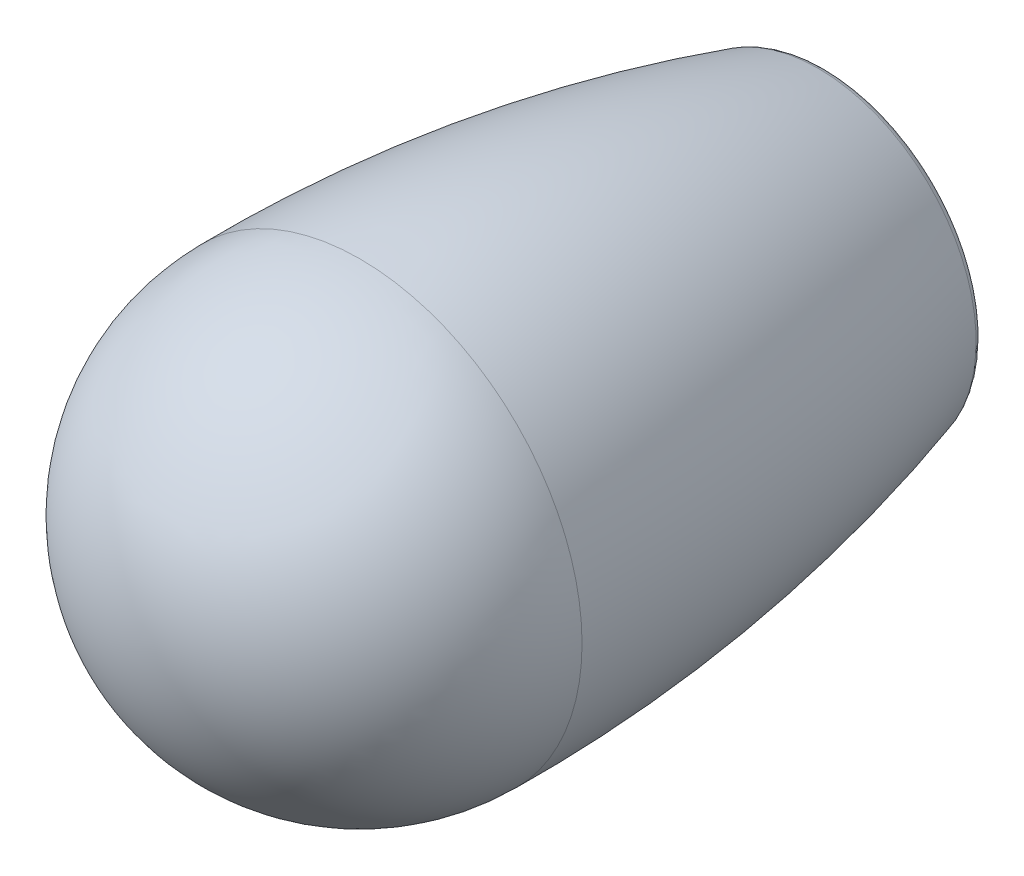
ISO-10303-21;
HEADER;
FILE_DESCRIPTION(('STEP AP214'),'2;1');
FILE_NAME('part.step','',(''),(''),'','','');
FILE_SCHEMA(('AUTOMOTIVE_DESIGN { 1 0 10303 214 1 1 1 1 }'));
ENDSEC;
DATA;
#1=APPLICATION_CONTEXT('core data for automotive mechanical design processes');
#2=APPLICATION_PROTOCOL_DEFINITION('international standard','automotive_design',2000,#1);
#3=PRODUCT_CONTEXT('',#1,'mechanical');
#4=PRODUCT('Part','Part','',(#3));
#5=PRODUCT_RELATED_PRODUCT_CATEGORY('part','',(#4));
#6=PRODUCT_DEFINITION_FORMATION('','',#4);
#7=PRODUCT_DEFINITION_CONTEXT('part definition',#1,'design');
#8=PRODUCT_DEFINITION('design','',#6,#7);
#9=PRODUCT_DEFINITION_SHAPE('','',#8);
#10=(LENGTH_UNIT() NAMED_UNIT(*) SI_UNIT(.MILLI.,.METRE.));
#11=(NAMED_UNIT(*) PLANE_ANGLE_UNIT() SI_UNIT($,.RADIAN.));
#12=(NAMED_UNIT(*) SI_UNIT($,.STERADIAN.) SOLID_ANGLE_UNIT());
#13=UNCERTAINTY_MEASURE_WITH_UNIT(LENGTH_MEASURE(1.E-05),#10,'distance_accuracy_value','');
#14=(GEOMETRIC_REPRESENTATION_CONTEXT(3) GLOBAL_UNCERTAINTY_ASSIGNED_CONTEXT((#13)) GLOBAL_UNIT_ASSIGNED_CONTEXT((#10,
#11,#12)) REPRESENTATION_CONTEXT('',''));
#15=CARTESIAN_POINT('',(0.,0.,0.));
#16=DIRECTION('',(0.,0.,1.));
#17=DIRECTION('',(1.,0.,0.));
#18=AXIS2_PLACEMENT_3D('',#15,#16,#17);
#19=CARTESIAN_POINT('',(-1.11022302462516E-13,0.,21.));
#20=DIRECTION('',(0.,0.,-1.));
#21=DIRECTION('',(1.,0.,0.));
#22=AXIS2_PLACEMENT_3D('',#19,#20,#21);
#23=SPHERICAL_SURFACE('',#22,9.99999999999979);
#24=CARTESIAN_POINT('',(0.,0.,21.000000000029));
#25=DIRECTION('',(0.,0.,-1.));
#26=DIRECTION('',(0.,1.,0.));
#27=AXIS2_PLACEMENT_3D('',#24,#25,#26);
#28=CIRCLE('',#27,9.99999999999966);
#29=CARTESIAN_POINT('',(0.,9.99999999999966,21.000000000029));
#30=VERTEX_POINT('',#29);
#31=EDGE_CURVE('E23',#30,#30,#28,.T.);
#32=ORIENTED_EDGE('',*,*,#31,.F.);
#33=EDGE_LOOP('',(#32));
#34=FACE_BOUND('',#33,.T.);
#35=ADVANCED_FACE('F12',(#34),#23,.T.);
#36=CARTESIAN_POINT('',(0.,0.,0.));
#37=DIRECTION('',(0.,0.,-1.));
#38=DIRECTION('',(0.,1.,0.));
#39=AXIS2_PLACEMENT_3D('',#36,#37,#38);
#40=PLANE('',#39);
#41=CARTESIAN_POINT('',(0.,0.,0.));
#42=DIRECTION('',(0.,0.,-1.));
#43=DIRECTION('',(0.,1.,0.));
#44=AXIS2_PLACEMENT_3D('',#41,#42,#43);
#45=CIRCLE('',#44,6.62794066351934);
#46=CARTESIAN_POINT('',(0.,6.62794066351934,0.));
#47=VERTEX_POINT('',#46);
#48=EDGE_CURVE('E19',#47,#47,#45,.T.);
#49=ORIENTED_EDGE('',*,*,#48,.T.);
#50=EDGE_LOOP('',(#49));
#51=FACE_BOUND('',#50,.T.);
#52=CARTESIAN_POINT('',(0.,0.,0.));
#53=DIRECTION('',(0.,0.,-1.));
#54=DIRECTION('',(0.,1.,0.));
#55=AXIS2_PLACEMENT_3D('',#52,#53,#54);
#56=CIRCLE('',#55,4.25);
#57=CARTESIAN_POINT('',(0.,4.25,0.));
#58=VERTEX_POINT('',#57);
#59=EDGE_CURVE('E27',#58,#58,#56,.T.);
#60=ORIENTED_EDGE('',*,*,#59,.F.);
#61=EDGE_LOOP('',(#60));
#62=FACE_BOUND('',#61,.T.);
#63=ADVANCED_FACE('F52',(#51,#62),#40,.T.);
#64=CARTESIAN_POINT('',(0.,0.,20.2851928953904));
#65=DIRECTION('',(0.,0.,-1.));
#66=DIRECTION('',(0.,1.,0.));
#67=AXIS2_PLACEMENT_3D('',#64,#65,#66);
#68=DEGENERATE_TOROIDAL_SURFACE('',#67,59.9963502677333,70.,.F.);
#69=CARTESIAN_POINT('',(0.,0.,0.357660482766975));
#70=DIRECTION('',(0.,0.,1.));
#71=DIRECTION('',(0.,-1.,0.));
#72=AXIS2_PLACEMENT_3D('',#69,#70,#71);
#73=CIRCLE('',#72,7.10725210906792);
#74=CARTESIAN_POINT('',(0.,-7.10725210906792,0.357660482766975));
#75=VERTEX_POINT('',#74);
#76=EDGE_CURVE('E8',#75,#75,#73,.T.);
#77=ORIENTED_EDGE('',*,*,#76,.T.);
#78=EDGE_LOOP('',(#77));
#79=FACE_BOUND('',#78,.T.);
#80=ORIENTED_EDGE('',*,*,#31,.T.);
#81=EDGE_LOOP('',(#80));
#82=FACE_BOUND('',#81,.T.);
#83=ADVANCED_FACE('F48',(#79,#82),#68,.F.);
#84=CARTESIAN_POINT('',(0.,0.,0.));
#85=DIRECTION('',(0.,0.,-1.));
#86=DIRECTION('',(0.,1.,0.));
#87=AXIS2_PLACEMENT_3D('',#84,#85,#86);
#88=CYLINDRICAL_SURFACE('',#87,4.25);
#89=CARTESIAN_POINT('',(0.,0.,3.5));
#90=DIRECTION('',(0.,0.,-1.));
#91=DIRECTION('',(0.,1.,0.));
#92=AXIS2_PLACEMENT_3D('',#89,#90,#91);
#93=CIRCLE('',#92,4.25);
#94=CARTESIAN_POINT('',(0.,4.25,3.5));
#95=VERTEX_POINT('',#94);
#96=EDGE_CURVE('E38',#95,#95,#93,.T.);
#97=ORIENTED_EDGE('',*,*,#96,.F.);
#98=EDGE_LOOP('',(#97));
#99=FACE_BOUND('',#98,.T.);
#100=ORIENTED_EDGE('',*,*,#59,.T.);
#101=EDGE_LOOP('',(#100));
#102=FACE_BOUND('',#101,.T.);
#103=ADVANCED_FACE('F44',(#99,#102),#88,.F.);
#104=CARTESIAN_POINT('',(0.,0.,20.));
#105=DIRECTION('',(0.,0.,1.));
#106=DIRECTION('',(0.,-1.,0.));
#107=AXIS2_PLACEMENT_3D('',#104,#105,#106);
#108=PLANE('',#107);
#109=CARTESIAN_POINT('',(0.,0.,20.));
#110=DIRECTION('',(0.,0.,-1.));
#111=DIRECTION('',(0.,1.,0.));
#112=AXIS2_PLACEMENT_3D('',#109,#110,#111);
#113=CIRCLE('',#112,4.);
#114=CARTESIAN_POINT('',(0.,4.,20.));
#115=VERTEX_POINT('',#114);
#116=EDGE_CURVE('E32',#115,#115,#113,.T.);
#117=ORIENTED_EDGE('',*,*,#116,.T.);
#118=EDGE_LOOP('',(#117));
#119=FACE_BOUND('',#118,.T.);
#120=ADVANCED_FACE('F47',(#119),#108,.F.);
#121=CARTESIAN_POINT('',(0.,0.,0.));
#122=DIRECTION('',(0.,0.,-1.));
#123=DIRECTION('',(0.,1.,0.));
#124=AXIS2_PLACEMENT_3D('',#121,#122,#123);
#125=CYLINDRICAL_SURFACE('',#124,4.);
#126=ORIENTED_EDGE('',*,*,#116,.F.);
#127=EDGE_LOOP('',(#126));
#128=FACE_BOUND('',#127,.T.);
#129=CARTESIAN_POINT('',(0.,0.,3.5));
#130=DIRECTION('',(0.,0.,-1.));
#131=DIRECTION('',(0.,1.,0.));
#132=AXIS2_PLACEMENT_3D('',#129,#130,#131);
#133=CIRCLE('',#132,4.);
#134=CARTESIAN_POINT('',(0.,4.,3.5));
#135=VERTEX_POINT('',#134);
#136=EDGE_CURVE('E35',#135,#135,#133,.T.);
#137=ORIENTED_EDGE('',*,*,#136,.T.);
#138=EDGE_LOOP('',(#137));
#139=FACE_BOUND('',#138,.T.);
#140=ADVANCED_FACE('F66',(#128,#139),#125,.F.);
#141=CARTESIAN_POINT('',(0.,4.25,3.5));
#142=DIRECTION('',(0.,0.,1.));
#143=DIRECTION('',(0.,-1.,0.));
#144=AXIS2_PLACEMENT_3D('',#141,#142,#143);
#145=PLANE('',#144);
#146=ORIENTED_EDGE('',*,*,#136,.F.);
#147=EDGE_LOOP('',(#146));
#148=FACE_BOUND('',#147,.T.);
#149=ORIENTED_EDGE('',*,*,#96,.T.);
#150=EDGE_LOOP('',(#149));
#151=FACE_BOUND('',#150,.T.);
#152=ADVANCED_FACE('F42',(#148,#151),#145,.F.);
#153=CARTESIAN_POINT('',(0.,0.,0.5));
#154=DIRECTION('',(0.,0.,-1.));
#155=DIRECTION('',(0.,1.,0.));
#156=AXIS2_PLACEMENT_3D('',#153,#154,#155);
#157=TOROIDAL_SURFACE('',#156,6.62794066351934,0.5);
#158=ORIENTED_EDGE('',*,*,#76,.F.);
#159=EDGE_LOOP('',(#158));
#160=FACE_BOUND('',#159,.T.);
#161=ORIENTED_EDGE('',*,*,#48,.F.);
#162=EDGE_LOOP('',(#161));
#163=FACE_BOUND('',#162,.T.);
#164=ADVANCED_FACE('F14',(#160,#163),#157,.T.);
#165=CLOSED_SHELL('',(#35,#63,#83,#103,#120,#140,#152,#164));
#166=MANIFOLD_SOLID_BREP('B1',#165);
#167=ADVANCED_BREP_SHAPE_REPRESENTATION('',(#18,#166),#14);
#168=SHAPE_DEFINITION_REPRESENTATION(#9,#167);
ENDSEC;
END-ISO-10303-21;
